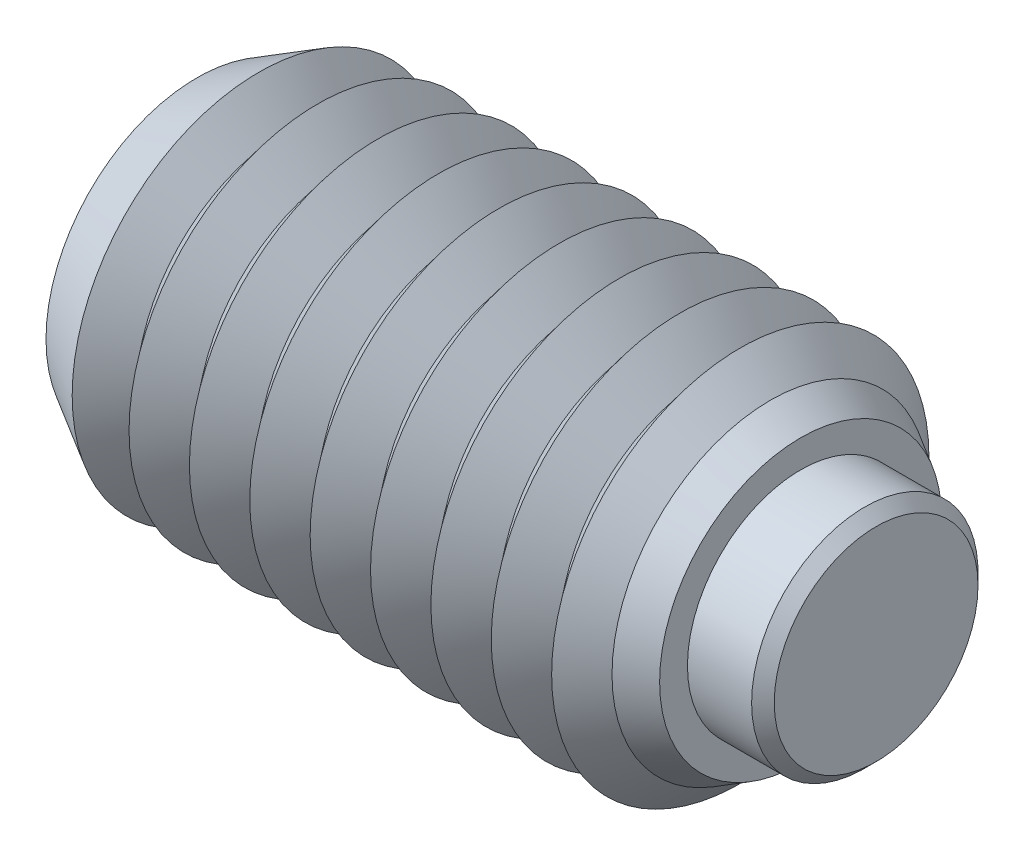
ISO-10303-21;
HEADER;
FILE_DESCRIPTION(('STEP AP214'),'2;1');
FILE_NAME('part.step','',(''),(''),'','','');
FILE_SCHEMA(('AUTOMOTIVE_DESIGN { 1 0 10303 214 1 1 1 1 }'));
ENDSEC;
DATA;
#1=APPLICATION_CONTEXT('core data for automotive mechanical design processes');
#2=APPLICATION_PROTOCOL_DEFINITION('international standard','automotive_design',2000,#1);
#3=PRODUCT_CONTEXT('',#1,'mechanical');
#4=PRODUCT('Part','Part','',(#3));
#5=PRODUCT_RELATED_PRODUCT_CATEGORY('part','',(#4));
#6=PRODUCT_DEFINITION_FORMATION('','',#4);
#7=PRODUCT_DEFINITION_CONTEXT('part definition',#1,'design');
#8=PRODUCT_DEFINITION('design','',#6,#7);
#9=PRODUCT_DEFINITION_SHAPE('','',#8);
#10=(LENGTH_UNIT() NAMED_UNIT(*) SI_UNIT(.MILLI.,.METRE.));
#11=(NAMED_UNIT(*) PLANE_ANGLE_UNIT() SI_UNIT($,.RADIAN.));
#12=(NAMED_UNIT(*) SI_UNIT($,.STERADIAN.) SOLID_ANGLE_UNIT());
#13=UNCERTAINTY_MEASURE_WITH_UNIT(LENGTH_MEASURE(1.E-05),#10,'distance_accuracy_value','');
#14=(GEOMETRIC_REPRESENTATION_CONTEXT(3) GLOBAL_UNCERTAINTY_ASSIGNED_CONTEXT((#13)) GLOBAL_UNIT_ASSIGNED_CONTEXT((#10,
#11,#12)) REPRESENTATION_CONTEXT('',''));
#15=CARTESIAN_POINT('',(0.,0.,0.));
#16=DIRECTION('',(0.,0.,1.));
#17=DIRECTION('',(1.,0.,0.));
#18=AXIS2_PLACEMENT_3D('',#15,#16,#17);
#19=CARTESIAN_POINT('',(1.4,0.,0.));
#20=DIRECTION('',(-1.,0.,0.));
#21=DIRECTION('',(0.,0.,1.));
#22=AXIS2_PLACEMENT_3D('',#19,#20,#21);
#23=CYLINDRICAL_SURFACE('',#22,1.5);
#24=CARTESIAN_POINT('',(1.25,0.,0.));
#25=DIRECTION('',(1.,0.,0.));
#26=DIRECTION('',(0.,0.,-1.));
#27=AXIS2_PLACEMENT_3D('',#24,#25,#26);
#28=CIRCLE('',#27,1.5);
#29=CARTESIAN_POINT('',(1.25,0.,1.5));
#30=VERTEX_POINT('',#29);
#31=EDGE_CURVE('P0_E10',#30,#30,#28,.F.);
#32=ORIENTED_EDGE('',*,*,#31,.T.);
#33=EDGE_LOOP('',(#32));
#34=FACE_BOUND('',#33,.T.);
#35=CARTESIAN_POINT('',(-0.6,0.,0.));
#36=DIRECTION('',(1.,0.,0.));
#37=DIRECTION('',(0.,0.,-1.));
#38=AXIS2_PLACEMENT_3D('',#35,#36,#37);
#39=CIRCLE('',#38,1.5);
#40=CARTESIAN_POINT('',(-0.6,0.,-1.5));
#41=VERTEX_POINT('',#40);
#42=EDGE_CURVE('P0_E25',#41,#41,#39,.T.);
#43=ORIENTED_EDGE('',*,*,#42,.T.);
#44=EDGE_LOOP('',(#43));
#45=FACE_BOUND('',#44,.T.);
#46=ADVANCED_FACE('P0_F14',(#34,#45),#23,.T.);
#47=CARTESIAN_POINT('',(1.4,0.,0.));
#48=DIRECTION('',(1.,0.,0.));
#49=DIRECTION('',(0.,0.,-1.));
#50=AXIS2_PLACEMENT_3D('',#47,#48,#49);
#51=PLANE('',#50);
#52=CARTESIAN_POINT('',(1.4,0.,0.));
#53=DIRECTION('',(1.,0.,0.));
#54=DIRECTION('',(0.,0.,-1.));
#55=AXIS2_PLACEMENT_3D('',#52,#53,#54);
#56=CIRCLE('',#55,1.35);
#57=CARTESIAN_POINT('',(1.4,0.,1.35));
#58=VERTEX_POINT('',#57);
#59=EDGE_CURVE('P0_E21',#58,#58,#56,.T.);
#60=ORIENTED_EDGE('',*,*,#59,.T.);
#61=EDGE_LOOP('',(#60));
#62=FACE_BOUND('',#61,.T.);
#63=ADVANCED_FACE('P0_F35',(#62),#51,.T.);
#64=CARTESIAN_POINT('',(-0.6,0.,0.));
#65=DIRECTION('',(1.,0.,0.));
#66=DIRECTION('',(0.,0.,-1.));
#67=AXIS2_PLACEMENT_3D('',#64,#65,#66);
#68=PLANE('',#67);
#69=ORIENTED_EDGE('',*,*,#42,.F.);
#70=EDGE_LOOP('',(#69));
#71=FACE_BOUND('',#70,.T.);
#72=ADVANCED_FACE('P0_F33',(#71),#68,.F.);
#73=CARTESIAN_POINT('',(1.4,0.,0.));
#74=DIRECTION('',(-1.,0.,0.));
#75=DIRECTION('',(0.,0.,1.));
#76=AXIS2_PLACEMENT_3D('',#73,#74,#75);
#77=CONICAL_SURFACE('',#76,1.35,0.785398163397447);
#78=CARTESIAN_POINT('',(1.25,0.,1.5));
#79=CARTESIAN_POINT('',(1.2515625,0.,1.4984375));
#80=CARTESIAN_POINT('',(1.253125,0.,1.496875));
#81=CARTESIAN_POINT('',(1.25625,0.,1.49375));
#82=CARTESIAN_POINT('',(1.2578125,0.,1.4921875));
#83=CARTESIAN_POINT('',(1.2609375,0.,1.4890625));
#84=CARTESIAN_POINT('',(1.2625,0.,1.4875));
#85=CARTESIAN_POINT('',(1.265625,0.,1.484375));
#86=CARTESIAN_POINT('',(1.2671875,0.,1.4828125));
#87=CARTESIAN_POINT('',(1.2703125,0.,1.4796875));
#88=CARTESIAN_POINT('',(1.271875,0.,1.478125));
#89=CARTESIAN_POINT('',(1.275,0.,1.475));
#90=CARTESIAN_POINT('',(1.2765625,0.,1.4734375));
#91=CARTESIAN_POINT('',(1.2796875,0.,1.4703125));
#92=CARTESIAN_POINT('',(1.28125,0.,1.46875));
#93=CARTESIAN_POINT('',(1.284375,0.,1.465625));
#94=CARTESIAN_POINT('',(1.2859375,0.,1.4640625));
#95=CARTESIAN_POINT('',(1.2890625,0.,1.4609375));
#96=CARTESIAN_POINT('',(1.290625,0.,1.459375));
#97=CARTESIAN_POINT('',(1.29375,0.,1.45625));
#98=CARTESIAN_POINT('',(1.2953125,0.,1.4546875));
#99=CARTESIAN_POINT('',(1.2984375,0.,1.4515625));
#100=CARTESIAN_POINT('',(1.3,0.,1.45));
#101=CARTESIAN_POINT('',(1.303125,0.,1.446875));
#102=CARTESIAN_POINT('',(1.3046875,0.,1.4453125));
#103=CARTESIAN_POINT('',(1.3078125,0.,1.4421875));
#104=CARTESIAN_POINT('',(1.309375,0.,1.440625));
#105=CARTESIAN_POINT('',(1.3125,0.,1.4375));
#106=CARTESIAN_POINT('',(1.3140625,0.,1.4359375));
#107=CARTESIAN_POINT('',(1.3171875,0.,1.4328125));
#108=CARTESIAN_POINT('',(1.31875,0.,1.43125));
#109=CARTESIAN_POINT('',(1.321875,0.,1.428125));
#110=CARTESIAN_POINT('',(1.3234375,0.,1.4265625));
#111=CARTESIAN_POINT('',(1.3265625,0.,1.4234375));
#112=CARTESIAN_POINT('',(1.328125,0.,1.421875));
#113=CARTESIAN_POINT('',(1.33125,0.,1.41875));
#114=CARTESIAN_POINT('',(1.3328125,0.,1.4171875));
#115=CARTESIAN_POINT('',(1.3359375,0.,1.4140625));
#116=CARTESIAN_POINT('',(1.3375,0.,1.4125));
#117=CARTESIAN_POINT('',(1.340625,0.,1.409375));
#118=CARTESIAN_POINT('',(1.3421875,0.,1.4078125));
#119=CARTESIAN_POINT('',(1.3453125,0.,1.4046875));
#120=CARTESIAN_POINT('',(1.346875,0.,1.403125));
#121=CARTESIAN_POINT('',(1.35,0.,1.4));
#122=CARTESIAN_POINT('',(1.3515625,0.,1.3984375));
#123=CARTESIAN_POINT('',(1.3546875,0.,1.3953125));
#124=CARTESIAN_POINT('',(1.35625,0.,1.39375));
#125=CARTESIAN_POINT('',(1.359375,0.,1.390625));
#126=CARTESIAN_POINT('',(1.3609375,0.,1.3890625));
#127=CARTESIAN_POINT('',(1.3640625,0.,1.3859375));
#128=CARTESIAN_POINT('',(1.365625,0.,1.384375));
#129=CARTESIAN_POINT('',(1.36875,0.,1.38125));
#130=CARTESIAN_POINT('',(1.3703125,0.,1.3796875));
#131=CARTESIAN_POINT('',(1.3734375,0.,1.3765625));
#132=CARTESIAN_POINT('',(1.375,0.,1.375));
#133=CARTESIAN_POINT('',(1.378125,0.,1.371875));
#134=CARTESIAN_POINT('',(1.3796875,0.,1.3703125));
#135=CARTESIAN_POINT('',(1.3828125,0.,1.3671875));
#136=CARTESIAN_POINT('',(1.384375,0.,1.365625));
#137=CARTESIAN_POINT('',(1.3875,0.,1.3625));
#138=CARTESIAN_POINT('',(1.3890625,0.,1.3609375));
#139=CARTESIAN_POINT('',(1.3921875,0.,1.3578125));
#140=CARTESIAN_POINT('',(1.39375,0.,1.35625));
#141=CARTESIAN_POINT('',(1.396875,0.,1.353125));
#142=CARTESIAN_POINT('',(1.3984375,0.,1.3515625));
#143=CARTESIAN_POINT('',(1.4,0.,1.35));
#144=B_SPLINE_CURVE_WITH_KNOTS('',3,(#78,#79,#80,#81,#82,#83,#84,#85,#86,#87,#88,#89,#90,#91,
#92,#93,#94,#95,#96,#97,#98,#99,#100,#101,#102,#103,#104,#105,#106,#107,#108,#109,#110,#111,
#112,#113,#114,#115,#116,#117,#118,#119,#120,#121,#122,#123,#124,#125,#126,#127,#128,#129,#130,
#131,#132,#133,#134,#135,#136,#137,#138,#139,#140,#141,#142,#143),.UNSPECIFIED.,.F.,.F.,(4,2,2,
2,2,2,2,2,2,2,2,2,2,2,2,2,2,2,2,2,2,2,2,2,2,2,2,2,2,2,2,2,4),(0.,0.00662912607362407,
0.0132582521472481,0.0198873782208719,0.0265165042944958,0.0331456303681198,0.0397747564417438,
0.0464038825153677,0.0530330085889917,0.0596621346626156,0.0662912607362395,0.0729203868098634,
0.0795495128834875,0.0861786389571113,0.0928077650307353,0.0994368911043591,0.106066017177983,
0.112695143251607,0.119324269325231,0.125953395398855,0.132582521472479,0.139211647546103,
0.145840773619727,0.152469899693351,0.159099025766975,0.165728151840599,0.172357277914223,
0.178986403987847,0.18561553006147,0.192244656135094,0.198873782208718,0.205502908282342,
0.212132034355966),.UNSPECIFIED.);
#145=EDGE_CURVE('P0_BSEAM16',#30,#58,#144,.T.);
#146=ORIENTED_EDGE('',*,*,#31,.F.);
#147=ORIENTED_EDGE('',*,*,#59,.F.);
#148=ORIENTED_EDGE('',*,*,#145,.T.);
#149=ORIENTED_EDGE('',*,*,#145,.F.);
#150=EDGE_LOOP('',(#146,#148,#147,#149));
#151=FACE_BOUND('',#150,.T.);
#152=ADVANCED_FACE('P0_F16',(#151),#77,.T.);
#153=CLOSED_SHELL('',(#46,#63,#72,#152));
#154=MANIFOLD_SOLID_BREP('P0_B1',#153);
#155=CARTESIAN_POINT('',(-6.8,0.,0.));
#156=DIRECTION('',(-1.,0.,0.));
#157=DIRECTION('',(0.,0.,1.));
#158=AXIS2_PLACEMENT_3D('',#155,#156,#157);
#159=CONICAL_SURFACE('',#158,2.5,0.895664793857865);
#160=CARTESIAN_POINT('',(-6.4,0.,0.));
#161=DIRECTION('',(1.,0.,0.));
#162=DIRECTION('',(0.,0.,-1.));
#163=AXIS2_PLACEMENT_3D('',#160,#161,#162);
#164=CIRCLE('',#163,2.00040016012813);
#165=CARTESIAN_POINT('',(-6.4,0.,-2.00040016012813));
#166=VERTEX_POINT('',#165);
#167=EDGE_CURVE('P1_E697',#166,#166,#164,.T.);
#168=ORIENTED_EDGE('',*,*,#167,.F.);
#169=EDGE_LOOP('',(#168));
#170=FACE_BOUND('',#169,.T.);
#171=CARTESIAN_POINT('',(-6.77934698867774,0.,0.));
#172=DIRECTION('',(1.,0.,0.));
#173=DIRECTION('',(0.,0.,-1.));
#174=AXIS2_PLACEMENT_3D('',#171,#172,#173);
#175=CIRCLE('',#174,2.47420439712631);
#176=CARTESIAN_POINT('',(-6.77934698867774,0.,-2.47420439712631));
#177=VERTEX_POINT('',#176);
#178=EDGE_CURVE('P1_E700',#177,#177,#175,.F.);
#179=ORIENTED_EDGE('',*,*,#178,.F.);
#180=EDGE_LOOP('',(#179));
#181=FACE_BOUND('',#180,.T.);
#182=ADVANCED_FACE('P1_F15',(#170,#181),#159,.T.);
#183=CARTESIAN_POINT('',(-0.8,0.,0.));
#184=DIRECTION('',(1.,0.,0.));
#185=DIRECTION('',(0.,0.,-1.));
#186=AXIS2_PLACEMENT_3D('',#183,#184,#185);
#187=CONICAL_SURFACE('',#186,2.00040016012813,0.895664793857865);
#188=CARTESIAN_POINT('',(-0.4,0.,0.));
#189=DIRECTION('',(1.,0.,0.));
#190=DIRECTION('',(0.,0.,-1.));
#191=AXIS2_PLACEMENT_3D('',#188,#189,#190);
#192=CIRCLE('',#191,2.5);
#193=CARTESIAN_POINT('',(-0.4,0.,-2.5));
#194=VERTEX_POINT('',#193);
#195=EDGE_CURVE('P1_E651',#194,#194,#192,.T.);
#196=ORIENTED_EDGE('',*,*,#195,.F.);
#197=EDGE_LOOP('',(#196));
#198=FACE_BOUND('',#197,.T.);
#199=CARTESIAN_POINT('',(-0.8,0.,0.));
#200=DIRECTION('',(1.,0.,0.));
#201=DIRECTION('',(0.,0.,-1.));
#202=AXIS2_PLACEMENT_3D('',#199,#200,#201);
#203=CIRCLE('',#202,2.00040016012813);
#204=CARTESIAN_POINT('',(-0.8,0.,-2.00040016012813));
#205=VERTEX_POINT('',#204);
#206=EDGE_CURVE('P1_E652',#205,#205,#203,.T.);
#207=ORIENTED_EDGE('',*,*,#206,.T.);
#208=EDGE_LOOP('',(#207));
#209=FACE_BOUND('',#208,.T.);
#210=ADVANCED_FACE('P1_F222',(#198,#209),#187,.T.);
#211=CARTESIAN_POINT('',(-1.2,0.,0.));
#212=DIRECTION('',(-1.,0.,0.));
#213=DIRECTION('',(0.,0.,1.));
#214=AXIS2_PLACEMENT_3D('',#211,#212,#213);
#215=CONICAL_SURFACE('',#214,2.5,0.895664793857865);
#216=ORIENTED_EDGE('',*,*,#206,.F.);
#217=EDGE_LOOP('',(#216));
#218=FACE_BOUND('',#217,.T.);
#219=CARTESIAN_POINT('',(-1.2,0.,0.));
#220=DIRECTION('',(1.,0.,0.));
#221=DIRECTION('',(0.,0.,-1.));
#222=AXIS2_PLACEMENT_3D('',#219,#220,#221);
#223=CIRCLE('',#222,2.5);
#224=CARTESIAN_POINT('',(-1.2,0.,-2.5));
#225=VERTEX_POINT('',#224);
#226=EDGE_CURVE('P1_E656',#225,#225,#223,.T.);
#227=ORIENTED_EDGE('',*,*,#226,.T.);
#228=EDGE_LOOP('',(#227));
#229=FACE_BOUND('',#228,.T.);
#230=ADVANCED_FACE('P1_F227',(#218,#229),#215,.T.);
#231=CARTESIAN_POINT('',(-0.6,0.,0.));
#232=DIRECTION('',(1.,0.,0.));
#233=DIRECTION('',(0.,1.,0.));
#234=AXIS2_PLACEMENT_3D('',#231,#232,#233);
#235=PLANE('',#234);
#236=CARTESIAN_POINT('',(-0.6,0.,0.));
#237=DIRECTION('',(1.,0.,0.));
#238=DIRECTION('',(0.,1.,0.));
#239=AXIS2_PLACEMENT_3D('',#236,#237,#238);
#240=CIRCLE('',#239,1.5);
#241=CARTESIAN_POINT('',(-0.6,1.5,0.));
#242=VERTEX_POINT('',#241);
#243=EDGE_CURVE('P1_E358',#242,#242,#240,.T.);
#244=ORIENTED_EDGE('',*,*,#243,.T.);
#245=EDGE_LOOP('',(#244));
#246=FACE_BOUND('',#245,.T.);
#247=ADVANCED_FACE('P1_F285',(#246),#235,.T.);
#248=CARTESIAN_POINT('',(-0.6,0.,0.));
#249=DIRECTION('',(1.,0.,0.));
#250=DIRECTION('',(0.,1.,0.));
#251=AXIS2_PLACEMENT_3D('',#248,#249,#250);
#252=CYLINDRICAL_SURFACE('',#251,1.5);
#253=ORIENTED_EDGE('',*,*,#243,.F.);
#254=EDGE_LOOP('',(#253));
#255=FACE_BOUND('',#254,.T.);
#256=CARTESIAN_POINT('',(0.4,0.,0.));
#257=DIRECTION('',(1.,0.,0.));
#258=DIRECTION('',(0.,1.,0.));
#259=AXIS2_PLACEMENT_3D('',#256,#257,#258);
#260=CIRCLE('',#259,1.5);
#261=CARTESIAN_POINT('',(0.4,1.5,0.));
#262=VERTEX_POINT('',#261);
#263=EDGE_CURVE('P1_E361',#262,#262,#260,.T.);
#264=ORIENTED_EDGE('',*,*,#263,.T.);
#265=EDGE_LOOP('',(#264));
#266=FACE_BOUND('',#265,.T.);
#267=ADVANCED_FACE('P1_F209',(#255,#266),#252,.F.);
#268=CARTESIAN_POINT('',(0.4,1.86905989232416,0.));
#269=DIRECTION('',(1.,0.,0.));
#270=DIRECTION('',(0.,1.,0.));
#271=AXIS2_PLACEMENT_3D('',#268,#269,#270);
#272=PLANE('',#271);
#273=ORIENTED_EDGE('',*,*,#263,.F.);
#274=EDGE_LOOP('',(#273));
#275=FACE_BOUND('',#274,.T.);
#276=CARTESIAN_POINT('',(0.4,0.,0.));
#277=DIRECTION('',(1.,0.,0.));
#278=DIRECTION('',(0.,1.,0.));
#279=AXIS2_PLACEMENT_3D('',#276,#277,#278);
#280=CIRCLE('',#279,1.86905989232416);
#281=CARTESIAN_POINT('',(0.4,1.86905989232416,0.));
#282=VERTEX_POINT('',#281);
#283=EDGE_CURVE('P1_E121',#282,#282,#280,.T.);
#284=ORIENTED_EDGE('',*,*,#283,.T.);
#285=EDGE_LOOP('',(#284));
#286=FACE_BOUND('',#285,.T.);
#287=ADVANCED_FACE('P1_F206',(#275,#286),#272,.T.);
#288=CARTESIAN_POINT('',(0.4,0.,0.));
#289=DIRECTION('',(-1.,0.,0.));
#290=DIRECTION('',(0.,-1.,0.));
#291=AXIS2_PLACEMENT_3D('',#288,#289,#290);
#292=CONICAL_SURFACE('',#291,1.86905989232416,0.523598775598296);
#293=CARTESIAN_POINT('',(0.,0.,0.));
#294=DIRECTION('',(1.,0.,0.));
#295=DIRECTION('',(0.,0.,-1.));
#296=AXIS2_PLACEMENT_3D('',#293,#294,#295);
#297=CIRCLE('',#296,2.1);
#298=CARTESIAN_POINT('',(0.,0.,-2.1));
#299=VERTEX_POINT('',#298);
#300=EDGE_CURVE('P1_E349',#299,#299,#297,.T.);
#301=ORIENTED_EDGE('',*,*,#300,.T.);
#302=EDGE_LOOP('',(#301));
#303=FACE_BOUND('',#302,.T.);
#304=ORIENTED_EDGE('',*,*,#283,.F.);
#305=EDGE_LOOP('',(#304));
#306=FACE_BOUND('',#305,.T.);
#307=ADVANCED_FACE('P1_F203',(#303,#306),#292,.T.);
#308=CARTESIAN_POINT('',(0.,0.,0.));
#309=DIRECTION('',(-1.,0.,0.));
#310=DIRECTION('',(0.,0.,1.));
#311=AXIS2_PLACEMENT_3D('',#308,#309,#310);
#312=CONICAL_SURFACE('',#311,2.1,0.785398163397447);
#313=ORIENTED_EDGE('',*,*,#195,.T.);
#314=EDGE_LOOP('',(#313));
#315=FACE_BOUND('',#314,.T.);
#316=ORIENTED_EDGE('',*,*,#300,.F.);
#317=EDGE_LOOP('',(#316));
#318=FACE_BOUND('',#317,.T.);
#319=ADVANCED_FACE('P1_F17',(#315,#318),#312,.T.);
#320=CARTESIAN_POINT('',(-1.6,0.,0.));
#321=DIRECTION('',(1.,0.,0.));
#322=DIRECTION('',(0.,0.,-1.));
#323=AXIS2_PLACEMENT_3D('',#320,#321,#322);
#324=CONICAL_SURFACE('',#323,2.00040016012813,0.895664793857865);
#325=ORIENTED_EDGE('',*,*,#226,.F.);
#326=EDGE_LOOP('',(#325));
#327=FACE_BOUND('',#326,.T.);
#328=CARTESIAN_POINT('',(-1.6,0.,0.));
#329=DIRECTION('',(1.,0.,0.));
#330=DIRECTION('',(0.,0.,-1.));
#331=AXIS2_PLACEMENT_3D('',#328,#329,#330);
#332=CIRCLE('',#331,2.00040016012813);
#333=CARTESIAN_POINT('',(-1.6,0.,-2.00040016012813));
#334=VERTEX_POINT('',#333);
#335=EDGE_CURVE('P1_E661',#334,#334,#332,.T.);
#336=ORIENTED_EDGE('',*,*,#335,.T.);
#337=EDGE_LOOP('',(#336));
#338=FACE_BOUND('',#337,.T.);
#339=ADVANCED_FACE('P1_F279',(#327,#338),#324,.T.);
#340=CARTESIAN_POINT('',(-2.,0.,0.));
#341=DIRECTION('',(-1.,0.,0.));
#342=DIRECTION('',(0.,0.,1.));
#343=AXIS2_PLACEMENT_3D('',#340,#341,#342);
#344=CONICAL_SURFACE('',#343,2.5,0.895664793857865);
#345=ORIENTED_EDGE('',*,*,#335,.F.);
#346=EDGE_LOOP('',(#345));
#347=FACE_BOUND('',#346,.T.);
#348=CARTESIAN_POINT('',(-2.,0.,0.));
#349=DIRECTION('',(1.,0.,0.));
#350=DIRECTION('',(0.,0.,-1.));
#351=AXIS2_PLACEMENT_3D('',#348,#349,#350);
#352=CIRCLE('',#351,2.5);
#353=CARTESIAN_POINT('',(-2.,0.,-2.5));
#354=VERTEX_POINT('',#353);
#355=EDGE_CURVE('P1_E664',#354,#354,#352,.T.);
#356=ORIENTED_EDGE('',*,*,#355,.T.);
#357=EDGE_LOOP('',(#356));
#358=FACE_BOUND('',#357,.T.);
#359=ADVANCED_FACE('P1_F275',(#347,#358),#344,.T.);
#360=CARTESIAN_POINT('',(-2.4,0.,0.));
#361=DIRECTION('',(1.,0.,0.));
#362=DIRECTION('',(0.,0.,-1.));
#363=AXIS2_PLACEMENT_3D('',#360,#361,#362);
#364=CONICAL_SURFACE('',#363,2.00040016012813,0.895664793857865);
#365=ORIENTED_EDGE('',*,*,#355,.F.);
#366=EDGE_LOOP('',(#365));
#367=FACE_BOUND('',#366,.T.);
#368=CARTESIAN_POINT('',(-2.4,0.,0.));
#369=DIRECTION('',(1.,0.,0.));
#370=DIRECTION('',(0.,0.,-1.));
#371=AXIS2_PLACEMENT_3D('',#368,#369,#370);
#372=CIRCLE('',#371,2.00040016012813);
#373=CARTESIAN_POINT('',(-2.4,0.,-2.00040016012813));
#374=VERTEX_POINT('',#373);
#375=EDGE_CURVE('P1_E667',#374,#374,#372,.T.);
#376=ORIENTED_EDGE('',*,*,#375,.T.);
#377=EDGE_LOOP('',(#376));
#378=FACE_BOUND('',#377,.T.);
#379=ADVANCED_FACE('P1_F271',(#367,#378),#364,.T.);
#380=CARTESIAN_POINT('',(-2.8,0.,0.));
#381=DIRECTION('',(-1.,0.,0.));
#382=DIRECTION('',(0.,0.,1.));
#383=AXIS2_PLACEMENT_3D('',#380,#381,#382);
#384=CONICAL_SURFACE('',#383,2.5,0.895664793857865);
#385=ORIENTED_EDGE('',*,*,#375,.F.);
#386=EDGE_LOOP('',(#385));
#387=FACE_BOUND('',#386,.T.);
#388=CARTESIAN_POINT('',(-2.8,0.,0.));
#389=DIRECTION('',(1.,0.,0.));
#390=DIRECTION('',(0.,0.,-1.));
#391=AXIS2_PLACEMENT_3D('',#388,#389,#390);
#392=CIRCLE('',#391,2.5);
#393=CARTESIAN_POINT('',(-2.8,0.,-2.5));
#394=VERTEX_POINT('',#393);
#395=EDGE_CURVE('P1_E670',#394,#394,#392,.T.);
#396=ORIENTED_EDGE('',*,*,#395,.T.);
#397=EDGE_LOOP('',(#396));
#398=FACE_BOUND('',#397,.T.);
#399=ADVANCED_FACE('P1_F267',(#387,#398),#384,.T.);
#400=CARTESIAN_POINT('',(-3.2,0.,0.));
#401=DIRECTION('',(1.,0.,0.));
#402=DIRECTION('',(0.,0.,-1.));
#403=AXIS2_PLACEMENT_3D('',#400,#401,#402);
#404=CONICAL_SURFACE('',#403,2.00040016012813,0.895664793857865);
#405=ORIENTED_EDGE('',*,*,#395,.F.);
#406=EDGE_LOOP('',(#405));
#407=FACE_BOUND('',#406,.T.);
#408=CARTESIAN_POINT('',(-3.2,0.,0.));
#409=DIRECTION('',(1.,0.,0.));
#410=DIRECTION('',(0.,0.,-1.));
#411=AXIS2_PLACEMENT_3D('',#408,#409,#410);
#412=CIRCLE('',#411,2.00040016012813);
#413=CARTESIAN_POINT('',(-3.2,0.,-2.00040016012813));
#414=VERTEX_POINT('',#413);
#415=EDGE_CURVE('P1_E673',#414,#414,#412,.T.);
#416=ORIENTED_EDGE('',*,*,#415,.T.);
#417=EDGE_LOOP('',(#416));
#418=FACE_BOUND('',#417,.T.);
#419=ADVANCED_FACE('P1_F263',(#407,#418),#404,.T.);
#420=CARTESIAN_POINT('',(-3.6,0.,0.));
#421=DIRECTION('',(-1.,0.,0.));
#422=DIRECTION('',(0.,0.,1.));
#423=AXIS2_PLACEMENT_3D('',#420,#421,#422);
#424=CONICAL_SURFACE('',#423,2.5,0.895664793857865);
#425=ORIENTED_EDGE('',*,*,#415,.F.);
#426=EDGE_LOOP('',(#425));
#427=FACE_BOUND('',#426,.T.);
#428=CARTESIAN_POINT('',(-3.6,0.,0.));
#429=DIRECTION('',(1.,0.,0.));
#430=DIRECTION('',(0.,0.,-1.));
#431=AXIS2_PLACEMENT_3D('',#428,#429,#430);
#432=CIRCLE('',#431,2.5);
#433=CARTESIAN_POINT('',(-3.6,0.,-2.5));
#434=VERTEX_POINT('',#433);
#435=EDGE_CURVE('P1_E676',#434,#434,#432,.T.);
#436=ORIENTED_EDGE('',*,*,#435,.T.);
#437=EDGE_LOOP('',(#436));
#438=FACE_BOUND('',#437,.T.);
#439=ADVANCED_FACE('P1_F259',(#427,#438),#424,.T.);
#440=CARTESIAN_POINT('',(-4.,0.,0.));
#441=DIRECTION('',(1.,0.,0.));
#442=DIRECTION('',(0.,0.,-1.));
#443=AXIS2_PLACEMENT_3D('',#440,#441,#442);
#444=CONICAL_SURFACE('',#443,2.00040016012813,0.895664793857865);
#445=ORIENTED_EDGE('',*,*,#435,.F.);
#446=EDGE_LOOP('',(#445));
#447=FACE_BOUND('',#446,.T.);
#448=CARTESIAN_POINT('',(-4.,0.,0.));
#449=DIRECTION('',(1.,0.,0.));
#450=DIRECTION('',(0.,0.,-1.));
#451=AXIS2_PLACEMENT_3D('',#448,#449,#450);
#452=CIRCLE('',#451,2.00040016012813);
#453=CARTESIAN_POINT('',(-4.,0.,-2.00040016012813));
#454=VERTEX_POINT('',#453);
#455=EDGE_CURVE('P1_E679',#454,#454,#452,.T.);
#456=ORIENTED_EDGE('',*,*,#455,.T.);
#457=EDGE_LOOP('',(#456));
#458=FACE_BOUND('',#457,.T.);
#459=ADVANCED_FACE('P1_F255',(#447,#458),#444,.T.);
#460=CARTESIAN_POINT('',(-4.4,0.,0.));
#461=DIRECTION('',(-1.,0.,0.));
#462=DIRECTION('',(0.,0.,1.));
#463=AXIS2_PLACEMENT_3D('',#460,#461,#462);
#464=CONICAL_SURFACE('',#463,2.5,0.895664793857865);
#465=ORIENTED_EDGE('',*,*,#455,.F.);
#466=EDGE_LOOP('',(#465));
#467=FACE_BOUND('',#466,.T.);
#468=CARTESIAN_POINT('',(-4.4,0.,0.));
#469=DIRECTION('',(1.,0.,0.));
#470=DIRECTION('',(0.,0.,-1.));
#471=AXIS2_PLACEMENT_3D('',#468,#469,#470);
#472=CIRCLE('',#471,2.5);
#473=CARTESIAN_POINT('',(-4.4,0.,-2.5));
#474=VERTEX_POINT('',#473);
#475=EDGE_CURVE('P1_E682',#474,#474,#472,.T.);
#476=ORIENTED_EDGE('',*,*,#475,.T.);
#477=EDGE_LOOP('',(#476));
#478=FACE_BOUND('',#477,.T.);
#479=ADVANCED_FACE('P1_F251',(#467,#478),#464,.T.);
#480=CARTESIAN_POINT('',(-4.8,0.,0.));
#481=DIRECTION('',(1.,0.,0.));
#482=DIRECTION('',(0.,0.,-1.));
#483=AXIS2_PLACEMENT_3D('',#480,#481,#482);
#484=CONICAL_SURFACE('',#483,2.00040016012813,0.895664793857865);
#485=ORIENTED_EDGE('',*,*,#475,.F.);
#486=EDGE_LOOP('',(#485));
#487=FACE_BOUND('',#486,.T.);
#488=CARTESIAN_POINT('',(-4.8,0.,0.));
#489=DIRECTION('',(1.,0.,0.));
#490=DIRECTION('',(0.,0.,-1.));
#491=AXIS2_PLACEMENT_3D('',#488,#489,#490);
#492=CIRCLE('',#491,2.00040016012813);
#493=CARTESIAN_POINT('',(-4.8,0.,-2.00040016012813));
#494=VERTEX_POINT('',#493);
#495=EDGE_CURVE('P1_E685',#494,#494,#492,.T.);
#496=ORIENTED_EDGE('',*,*,#495,.T.);
#497=EDGE_LOOP('',(#496));
#498=FACE_BOUND('',#497,.T.);
#499=ADVANCED_FACE('P1_F247',(#487,#498),#484,.T.);
#500=CARTESIAN_POINT('',(-5.2,0.,0.));
#501=DIRECTION('',(-1.,0.,0.));
#502=DIRECTION('',(0.,0.,1.));
#503=AXIS2_PLACEMENT_3D('',#500,#501,#502);
#504=CONICAL_SURFACE('',#503,2.5,0.895664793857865);
#505=ORIENTED_EDGE('',*,*,#495,.F.);
#506=EDGE_LOOP('',(#505));
#507=FACE_BOUND('',#506,.T.);
#508=CARTESIAN_POINT('',(-5.2,0.,0.));
#509=DIRECTION('',(1.,0.,0.));
#510=DIRECTION('',(0.,0.,-1.));
#511=AXIS2_PLACEMENT_3D('',#508,#509,#510);
#512=CIRCLE('',#511,2.5);
#513=CARTESIAN_POINT('',(-5.2,0.,-2.5));
#514=VERTEX_POINT('',#513);
#515=EDGE_CURVE('P1_E688',#514,#514,#512,.T.);
#516=ORIENTED_EDGE('',*,*,#515,.T.);
#517=EDGE_LOOP('',(#516));
#518=FACE_BOUND('',#517,.T.);
#519=ADVANCED_FACE('P1_F243',(#507,#518),#504,.T.);
#520=CARTESIAN_POINT('',(-5.6,0.,0.));
#521=DIRECTION('',(1.,0.,0.));
#522=DIRECTION('',(0.,0.,-1.));
#523=AXIS2_PLACEMENT_3D('',#520,#521,#522);
#524=CONICAL_SURFACE('',#523,2.00040016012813,0.895664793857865);
#525=ORIENTED_EDGE('',*,*,#515,.F.);
#526=EDGE_LOOP('',(#525));
#527=FACE_BOUND('',#526,.T.);
#528=CARTESIAN_POINT('',(-5.6,0.,0.));
#529=DIRECTION('',(1.,0.,0.));
#530=DIRECTION('',(0.,0.,-1.));
#531=AXIS2_PLACEMENT_3D('',#528,#529,#530);
#532=CIRCLE('',#531,2.00040016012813);
#533=CARTESIAN_POINT('',(-5.6,0.,-2.00040016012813));
#534=VERTEX_POINT('',#533);
#535=EDGE_CURVE('P1_E691',#534,#534,#532,.T.);
#536=ORIENTED_EDGE('',*,*,#535,.T.);
#537=EDGE_LOOP('',(#536));
#538=FACE_BOUND('',#537,.T.);
#539=ADVANCED_FACE('P1_F239',(#527,#538),#524,.T.);
#540=CARTESIAN_POINT('',(-6.,0.,0.));
#541=DIRECTION('',(-1.,0.,0.));
#542=DIRECTION('',(0.,0.,1.));
#543=AXIS2_PLACEMENT_3D('',#540,#541,#542);
#544=CONICAL_SURFACE('',#543,2.5,0.895664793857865);
#545=ORIENTED_EDGE('',*,*,#535,.F.);
#546=EDGE_LOOP('',(#545));
#547=FACE_BOUND('',#546,.T.);
#548=CARTESIAN_POINT('',(-6.,0.,0.));
#549=DIRECTION('',(1.,0.,0.));
#550=DIRECTION('',(0.,0.,-1.));
#551=AXIS2_PLACEMENT_3D('',#548,#549,#550);
#552=CIRCLE('',#551,2.5);
#553=CARTESIAN_POINT('',(-6.,0.,-2.5));
#554=VERTEX_POINT('',#553);
#555=EDGE_CURVE('P1_E694',#554,#554,#552,.T.);
#556=ORIENTED_EDGE('',*,*,#555,.T.);
#557=EDGE_LOOP('',(#556));
#558=FACE_BOUND('',#557,.T.);
#559=ADVANCED_FACE('P1_F235',(#547,#558),#544,.T.);
#560=CARTESIAN_POINT('',(-6.4,0.,0.));
#561=DIRECTION('',(1.,0.,0.));
#562=DIRECTION('',(0.,0.,-1.));
#563=AXIS2_PLACEMENT_3D('',#560,#561,#562);
#564=CONICAL_SURFACE('',#563,2.00040016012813,0.895664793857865);
#565=ORIENTED_EDGE('',*,*,#555,.F.);
#566=EDGE_LOOP('',(#565));
#567=FACE_BOUND('',#566,.T.);
#568=ORIENTED_EDGE('',*,*,#167,.T.);
#569=EDGE_LOOP('',(#568));
#570=FACE_BOUND('',#569,.T.);
#571=ADVANCED_FACE('P1_F219',(#567,#570),#564,.T.);
#572=CARTESIAN_POINT('',(-7.6,0.,0.));
#573=DIRECTION('',(1.,0.,0.));
#574=DIRECTION('',(0.,0.,1.));
#575=AXIS2_PLACEMENT_3D('',#572,#573,#574);
#576=CONICAL_SURFACE('',#575,2.00040016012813,0.5235987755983);
#577=CARTESIAN_POINT('',(-7.6,0.,0.));
#578=DIRECTION('',(-1.,0.,0.));
#579=DIRECTION('',(0.,0.,1.));
#580=AXIS2_PLACEMENT_3D('',#577,#578,#579);
#581=CIRCLE('',#580,2.00040016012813);
#582=CARTESIAN_POINT('',(-7.6,0.,2.00040016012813));
#583=VERTEX_POINT('',#582);
#584=EDGE_CURVE('P1_E702',#583,#583,#581,.T.);
#585=ORIENTED_EDGE('',*,*,#584,.F.);
#586=EDGE_LOOP('',(#585));
#587=FACE_BOUND('',#586,.T.);
#588=ORIENTED_EDGE('',*,*,#178,.T.);
#589=EDGE_LOOP('',(#588));
#590=FACE_BOUND('',#589,.T.);
#591=ADVANCED_FACE('P1_F159',(#587,#590),#576,.T.);
#592=CARTESIAN_POINT('',(-7.6,0.,0.));
#593=DIRECTION('',(1.,0.,0.));
#594=DIRECTION('',(0.,0.,-1.));
#595=AXIS2_PLACEMENT_3D('',#592,#593,#594);
#596=PLANE('',#595);
#597=CARTESIAN_POINT('',(-7.6,0.,0.));
#598=DIRECTION('',(1.,0.,0.));
#599=DIRECTION('',(0.,0.,-1.));
#600=AXIS2_PLACEMENT_3D('',#597,#598,#599);
#601=CIRCLE('',#600,1.44337567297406);
#602=CARTESIAN_POINT('',(-7.6,-1.25,-0.72168783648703));
#603=VERTEX_POINT('',#602);
#604=CARTESIAN_POINT('',(-7.6,0.,-1.44337567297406));
#605=VERTEX_POINT('',#604);
#606=EDGE_CURVE('P1_E19',#603,#605,#601,.T.);
#607=ORIENTED_EDGE('',*,*,#606,.T.);
#608=CARTESIAN_POINT('',(-7.6,1.25,-0.721687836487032));
#609=VERTEX_POINT('',#608);
#610=EDGE_CURVE('P1_E10',#605,#609,#601,.T.);
#611=ORIENTED_EDGE('',*,*,#610,.T.);
#612=CARTESIAN_POINT('',(-7.6,1.25,0.721687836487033));
#613=VERTEX_POINT('',#612);
#614=EDGE_CURVE('P1_E24',#609,#613,#601,.T.);
#615=ORIENTED_EDGE('',*,*,#614,.T.);
#616=CARTESIAN_POINT('',(-7.6,0.,0.));
#617=DIRECTION('',(-1.,0.,0.));
#618=DIRECTION('',(0.,0.,1.));
#619=AXIS2_PLACEMENT_3D('',#616,#617,#618);
#620=CIRCLE('',#619,1.44337567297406);
#621=CARTESIAN_POINT('',(-7.6,0.,1.44337567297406));
#622=VERTEX_POINT('',#621);
#623=EDGE_CURVE('P1_E92',#622,#613,#620,.T.);
#624=ORIENTED_EDGE('',*,*,#623,.F.);
#625=CARTESIAN_POINT('',(-7.6,-1.25,0.721687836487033));
#626=VERTEX_POINT('',#625);
#627=EDGE_CURVE('P1_E101',#622,#626,#601,.T.);
#628=ORIENTED_EDGE('',*,*,#627,.T.);
#629=EDGE_CURVE('P1_E107',#626,#603,#601,.T.);
#630=ORIENTED_EDGE('',*,*,#629,.T.);
#631=EDGE_LOOP('',(#607,#611,#615,#624,#628,#630));
#632=FACE_BOUND('',#631,.T.);
#633=ORIENTED_EDGE('',*,*,#584,.T.);
#634=EDGE_LOOP('',(#633));
#635=FACE_BOUND('',#634,.T.);
#636=ADVANCED_FACE('P1_F108',(#632,#635),#596,.F.);
#637=CARTESIAN_POINT('',(-7.6,0.,0.));
#638=DIRECTION('',(-1.,0.,0.));
#639=DIRECTION('',(0.,0.,1.));
#640=AXIS2_PLACEMENT_3D('',#637,#638,#639);
#641=CONICAL_SURFACE('',#640,1.44337567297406,1.0471975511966);
#642=ORIENTED_EDGE('',*,*,#606,.F.);
#643=CARTESIAN_POINT('',(-7.60006667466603,0.000200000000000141,-1.4434911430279));
#644=CARTESIAN_POINT('',(-7.58174591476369,-0.0547333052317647,-1.41177538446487));
#645=CARTESIAN_POINT('',(-7.56508330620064,-0.110140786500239,-1.37978586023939));
#646=CARTESIAN_POINT('',(-7.53599730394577,-0.22191536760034,-1.31525277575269));
#647=CARTESIAN_POINT('',(-7.52358420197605,-0.27828445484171,-1.28270806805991));
#648=CARTESIAN_POINT('',(-7.50425968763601,-0.390323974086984,-1.21802202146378));
#649=CARTESIAN_POINT('',(-7.49721968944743,-0.445977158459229,-1.1858906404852));
#650=CARTESIAN_POINT('',(-7.48881243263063,-0.557545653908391,-1.12147653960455));
#651=CARTESIAN_POINT('',(-7.48743821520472,-0.6134605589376,-1.08919405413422));
#652=CARTESIAN_POINT('',(-7.49028333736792,-0.717957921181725,-1.02886247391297));
#653=CARTESIAN_POINT('',(-7.49380409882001,-0.766555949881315,-1.00080438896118));
#654=CARTESIAN_POINT('',(-7.50496711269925,-0.863435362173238,-0.944871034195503));
#655=CARTESIAN_POINT('',(-7.51261318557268,-0.911716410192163,-0.916995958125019));
#656=CARTESIAN_POINT('',(-7.53172945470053,-1.00879588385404,-0.860947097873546));
#657=CARTESIAN_POINT('',(-7.54328075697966,-1.0575820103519,-0.832780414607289));
#658=CARTESIAN_POINT('',(-7.56949831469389,-1.1544262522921,-0.776867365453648));
#659=CARTESIAN_POINT('',(-7.5841584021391,-1.20248561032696,-0.749120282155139));
#660=CARTESIAN_POINT('',(-7.60006667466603,-1.2502,-0.721572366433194));
#661=B_SPLINE_CURVE_WITH_KNOTS('',3,(#643,#644,#645,#646,#647,#648,#649,#650,#651,#652,#653,
#654,#655,#656,#657,#658,#659,#660),.UNSPECIFIED.,.F.,.F.,(4,2,2,2,2,2,2,2,4),(0.,
0.198150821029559,0.396778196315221,0.590488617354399,0.783961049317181,0.952480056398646,
1.1211553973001,1.2935743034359,1.4656542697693),.UNSPECIFIED.);
#662=EDGE_CURVE('P1_E130',#605,#603,#661,.T.);
#663=ORIENTED_EDGE('',*,*,#662,.F.);
#664=EDGE_LOOP('',(#642,#663));
#665=FACE_BOUND('',#664,.T.);
#666=ADVANCED_FACE('P1_F158',(#665),#641,.F.);
#667=ORIENTED_EDGE('',*,*,#629,.F.);
#668=CARTESIAN_POINT('',(-8.06479411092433,-1.25,-1.86893140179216));
#669=CARTESIAN_POINT('',(-8.03889683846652,-1.25,-1.81495202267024));
#670=CARTESIAN_POINT('',(-8.01326862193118,-1.25,-1.76084125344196));
#671=CARTESIAN_POINT('',(-7.96270276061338,-1.25,-1.65228662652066));
#672=CARTESIAN_POINT('',(-7.9377652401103,-1.25,-1.59784271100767));
#673=CARTESIAN_POINT('',(-7.88859391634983,-1.25,-1.48823931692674));
#674=CARTESIAN_POINT('',(-7.86436529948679,-1.25,-1.43307750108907));
#675=CARTESIAN_POINT('',(-7.81699507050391,-1.25,-1.3222918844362));
#676=CARTESIAN_POINT('',(-7.79385340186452,-1.25,-1.26666810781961));
#677=CARTESIAN_POINT('',(-7.7483546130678,-1.25,-1.15340083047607));
#678=CARTESIAN_POINT('',(-7.7260338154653,-1.25,-1.09574254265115));
#679=CARTESIAN_POINT('',(-7.68325547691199,-1.25,-0.979741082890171));
#680=CARTESIAN_POINT('',(-7.66279816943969,-1.25,-0.921397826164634));
#681=CARTESIAN_POINT('',(-7.60508423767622,-1.25,-0.745435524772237));
#682=CARTESIAN_POINT('',(-7.5713502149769,-1.25,-0.626561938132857));
#683=CARTESIAN_POINT('',(-7.53222040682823,-1.25,-0.445873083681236));
#684=CARTESIAN_POINT('',(-7.52109406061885,-1.25,-0.385304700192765));
#685=CARTESIAN_POINT('',(-7.50342785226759,-1.25,-0.263486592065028));
#686=CARTESIAN_POINT('',(-7.49688768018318,-1.25,-0.202236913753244));
#687=CARTESIAN_POINT('',(-7.48899878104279,-1.25,-0.0801324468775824));
#688=CARTESIAN_POINT('',(-7.48758879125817,-1.25,-0.0192817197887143));
#689=CARTESIAN_POINT('',(-7.48991618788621,-1.25,0.102319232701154));
#690=CARTESIAN_POINT('',(-7.49365389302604,-1.25,0.163069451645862));
#691=CARTESIAN_POINT('',(-7.50889802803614,-1.25,0.312961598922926));
#692=CARTESIAN_POINT('',(-7.5232612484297,-1.25,0.401813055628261));
#693=CARTESIAN_POINT('',(-7.56029984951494,-1.25,0.5777881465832));
#694=CARTESIAN_POINT('',(-7.58298524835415,-1.25,0.66490956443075));
#695=CARTESIAN_POINT('',(-7.62173745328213,-1.25,0.795209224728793));
#696=CARTESIAN_POINT('',(-7.63562294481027,-1.25,0.839061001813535));
#697=CARTESIAN_POINT('',(-7.66467841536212,-1.25,0.926308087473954));
#698=CARTESIAN_POINT('',(-7.67984759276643,-1.25,0.969703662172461));
#699=CARTESIAN_POINT('',(-7.71125013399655,-1.25,1.05609633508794));
#700=CARTESIAN_POINT('',(-7.72748330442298,-1.25,1.09909350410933));
#701=CARTESIAN_POINT('',(-7.76083824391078,-1.25,1.1847490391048));
#702=CARTESIAN_POINT('',(-7.77796016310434,-1.25,1.22740734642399));
#703=CARTESIAN_POINT('',(-7.82276142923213,-1.25,1.33629459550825));
#704=CARTESIAN_POINT('',(-7.85096938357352,-1.25,1.40230581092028));
#705=CARTESIAN_POINT('',(-7.90874508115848,-1.25,1.53373213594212));
#706=CARTESIAN_POINT('',(-7.93831292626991,-1.25,1.59914720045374));
#707=CARTESIAN_POINT('',(-8.02857692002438,-1.25,1.79469680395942));
#708=CARTESIAN_POINT('',(-8.09082427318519,-1.25,1.92411390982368));
#709=CARTESIAN_POINT('',(-8.21792962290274,-1.25,2.18184246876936));
#710=CARTESIAN_POINT('',(-8.28279073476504,-1.25,2.31015236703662));
#711=CARTESIAN_POINT('',(-8.41418074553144,-1.25,2.56589305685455));
#712=CARTESIAN_POINT('',(-8.48070943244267,-1.25,2.69332395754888));
#713=CARTESIAN_POINT('',(-8.60858200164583,-1.25,2.93557826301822));
#714=CARTESIAN_POINT('',(-8.66982257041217,-1.25,3.05045639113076));
#715=CARTESIAN_POINT('',(-8.79300148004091,-1.25,3.27984311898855));
#716=CARTESIAN_POINT('',(-8.85493984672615,-1.25,3.39435170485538));
#717=CARTESIAN_POINT('',(-8.97918115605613,-1.25,3.62279327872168));
#718=CARTESIAN_POINT('',(-9.04148277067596,-1.25,3.73672698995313));
#719=CARTESIAN_POINT('',(-9.16649149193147,-1.25,3.96436406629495));
#720=CARTESIAN_POINT('',(-9.22919857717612,-1.25,4.07806744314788));
#721=CARTESIAN_POINT('',(-9.29205434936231,-1.25,4.19168806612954));
#722=B_SPLINE_CURVE_WITH_KNOTS('',3,(#668,#669,#670,#671,#672,#673,#674,#675,#676,#677,#678,
#679,#680,#681,#682,#683,#684,#685,#686,#687,#688,#689,#690,#691,#692,#693,#694,#695,#696,#697,
#698,#699,#700,#701,#702,#703,#704,#705,#706,#707,#708,#709,#710,#711,#712,#713,#714,#715,#716,
#717,#718,#719,#720,#721),.UNSPECIFIED.,.F.,.F.,(4,2,2,2,2,2,2,2,2,2,2,2,2,2,2,2,2,2,2,2,2,2,2,
2,2,2,4),(0.,0.179612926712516,0.359257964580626,0.53999273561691,0.720718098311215,
0.906167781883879,1.09164066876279,1.4615401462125,1.64614554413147,1.83073846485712,
2.0131196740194,2.19551217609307,2.46497297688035,2.73475922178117,2.87273702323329,
3.01062928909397,3.14849655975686,3.28638719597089,3.50172172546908,3.7170724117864,
4.14784491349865,4.57914698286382,5.01039449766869,5.40093821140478,5.79149642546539,
6.18106124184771,6.57060567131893),.UNSPECIFIED.);
#723=EDGE_CURVE('P1_E128',#603,#626,#722,.T.);
#724=ORIENTED_EDGE('',*,*,#723,.F.);
#725=EDGE_LOOP('',(#667,#724));
#726=FACE_BOUND('',#725,.T.);
#727=ADVANCED_FACE('P1_F217',(#726),#641,.F.);
#728=ORIENTED_EDGE('',*,*,#627,.F.);
#729=CARTESIAN_POINT('',(-7.60006667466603,-1.2502,0.721572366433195));
#730=CARTESIAN_POINT('',(-7.58174591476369,-1.19526669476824,0.75328812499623));
#731=CARTESIAN_POINT('',(-7.56508330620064,-1.13985921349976,0.785277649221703));
#732=CARTESIAN_POINT('',(-7.53599730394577,-1.02808463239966,0.849810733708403));
#733=CARTESIAN_POINT('',(-7.52358420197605,-0.97171554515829,0.882355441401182));
#734=CARTESIAN_POINT('',(-7.50425968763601,-0.859676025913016,0.947041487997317));
#735=CARTESIAN_POINT('',(-7.49721968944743,-0.804022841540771,0.979172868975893));
#736=CARTESIAN_POINT('',(-7.48881243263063,-0.692454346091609,1.04358696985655));
#737=CARTESIAN_POINT('',(-7.48743821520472,-0.6365394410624,1.07586945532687));
#738=CARTESIAN_POINT('',(-7.49028333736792,-0.532042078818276,1.13620103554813));
#739=CARTESIAN_POINT('',(-7.49380409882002,-0.483444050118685,1.16425912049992));
#740=CARTESIAN_POINT('',(-7.50496711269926,-0.386564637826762,1.22019247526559));
#741=CARTESIAN_POINT('',(-7.51261318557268,-0.338283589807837,1.24806755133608));
#742=CARTESIAN_POINT('',(-7.53172945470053,-0.241204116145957,1.30411641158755));
#743=CARTESIAN_POINT('',(-7.54328075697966,-0.192417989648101,1.33228309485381));
#744=CARTESIAN_POINT('',(-7.56949831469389,-0.095573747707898,1.38819614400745));
#745=CARTESIAN_POINT('',(-7.58415840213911,-0.0475143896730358,1.41594322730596));
#746=CARTESIAN_POINT('',(-7.60006667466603,0.000200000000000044,1.4434911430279));
#747=B_SPLINE_CURVE_WITH_KNOTS('',3,(#729,#730,#731,#732,#733,#734,#735,#736,#737,#738,#739,
#740,#741,#742,#743,#744,#745,#746),.UNSPECIFIED.,.F.,.F.,(4,2,2,2,2,2,2,2,4),(0.,
0.198150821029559,0.39677819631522,0.590488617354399,0.783961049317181,0.952480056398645,
1.1211553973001,1.2935743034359,1.4656542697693),.UNSPECIFIED.);
#748=EDGE_CURVE('P1_E96',#626,#622,#747,.T.);
#749=ORIENTED_EDGE('',*,*,#748,.F.);
#750=EDGE_LOOP('',(#728,#749));
#751=FACE_BOUND('',#750,.T.);
#752=ADVANCED_FACE('P1_F102',(#751),#641,.F.);
#753=ORIENTED_EDGE('',*,*,#623,.T.);
#754=CARTESIAN_POINT('',(-7.60006667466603,-0.000200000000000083,1.4434911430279));
#755=CARTESIAN_POINT('',(-7.58174591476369,0.0547333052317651,1.41177538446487));
#756=CARTESIAN_POINT('',(-7.56508330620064,0.11014078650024,1.37978586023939));
#757=CARTESIAN_POINT('',(-7.53599730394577,0.22191536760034,1.31525277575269));
#758=CARTESIAN_POINT('',(-7.52358420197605,0.27828445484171,1.28270806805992));
#759=CARTESIAN_POINT('',(-7.50425968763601,0.390323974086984,1.21802202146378));
#760=CARTESIAN_POINT('',(-7.49721968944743,0.445977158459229,1.1858906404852));
#761=CARTESIAN_POINT('',(-7.48881243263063,0.557545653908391,1.12147653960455));
#762=CARTESIAN_POINT('',(-7.48743821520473,0.6134605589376,1.08919405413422));
#763=CARTESIAN_POINT('',(-7.49028333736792,0.717957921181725,1.02886247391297));
#764=CARTESIAN_POINT('',(-7.49380409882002,0.766555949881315,1.00080438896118));
#765=CARTESIAN_POINT('',(-7.50496711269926,0.863435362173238,0.944871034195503));
#766=CARTESIAN_POINT('',(-7.51261318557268,0.911716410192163,0.91699595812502));
#767=CARTESIAN_POINT('',(-7.53172945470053,1.00879588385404,0.860947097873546));
#768=CARTESIAN_POINT('',(-7.54328075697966,1.0575820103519,0.83278041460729));
#769=CARTESIAN_POINT('',(-7.56949831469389,1.1544262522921,0.776867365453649));
#770=CARTESIAN_POINT('',(-7.58415840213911,1.20248561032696,0.74912028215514));
#771=CARTESIAN_POINT('',(-7.60006667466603,1.2502,0.721572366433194));
#772=B_SPLINE_CURVE_WITH_KNOTS('',3,(#754,#755,#756,#757,#758,#759,#760,#761,#762,#763,#764,
#765,#766,#767,#768,#769,#770,#771),.UNSPECIFIED.,.F.,.F.,(4,2,2,2,2,2,2,2,4),(0.,
0.19815082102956,0.396778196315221,0.5904886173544,0.783961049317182,0.952480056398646,
1.1211553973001,1.2935743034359,1.4656542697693),.UNSPECIFIED.);
#773=EDGE_CURVE('P1_E88',#622,#613,#772,.T.);
#774=ORIENTED_EDGE('',*,*,#773,.F.);
#775=EDGE_LOOP('',(#753,#774));
#776=FACE_BOUND('',#775,.T.);
#777=ADVANCED_FACE('P1_F90',(#776),#641,.F.);
#778=ORIENTED_EDGE('',*,*,#614,.F.);
#779=CARTESIAN_POINT('',(-8.06479411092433,1.25,-1.86893140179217));
#780=CARTESIAN_POINT('',(-8.03889683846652,1.25,-1.81495202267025));
#781=CARTESIAN_POINT('',(-8.01326862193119,1.25,-1.76084125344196));
#782=CARTESIAN_POINT('',(-7.96270276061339,1.25,-1.65228662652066));
#783=CARTESIAN_POINT('',(-7.93776524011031,1.25,-1.59784271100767));
#784=CARTESIAN_POINT('',(-7.88859391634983,1.25,-1.48823931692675));
#785=CARTESIAN_POINT('',(-7.8643652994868,1.25,-1.43307750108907));
#786=CARTESIAN_POINT('',(-7.81699507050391,1.25,-1.3222918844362));
#787=CARTESIAN_POINT('',(-7.79385340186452,1.25,-1.26666810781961));
#788=CARTESIAN_POINT('',(-7.74835461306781,1.25,-1.15340083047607));
#789=CARTESIAN_POINT('',(-7.7260338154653,1.25,-1.09574254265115));
#790=CARTESIAN_POINT('',(-7.68325547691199,1.25,-0.979741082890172));
#791=CARTESIAN_POINT('',(-7.66279816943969,1.25,-0.921397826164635));
#792=CARTESIAN_POINT('',(-7.60508423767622,1.25,-0.745435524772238));
#793=CARTESIAN_POINT('',(-7.57135021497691,1.25,-0.626561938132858));
#794=CARTESIAN_POINT('',(-7.53222040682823,1.25,-0.445873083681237));
#795=CARTESIAN_POINT('',(-7.52109406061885,1.25,-0.385304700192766));
#796=CARTESIAN_POINT('',(-7.50342785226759,1.25,-0.263486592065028));
#797=CARTESIAN_POINT('',(-7.49688768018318,1.25,-0.202236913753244));
#798=CARTESIAN_POINT('',(-7.48899878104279,1.25,-0.0801324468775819));
#799=CARTESIAN_POINT('',(-7.48758879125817,1.25,-0.0192817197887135));
#800=CARTESIAN_POINT('',(-7.48991618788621,1.25,0.102319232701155));
#801=CARTESIAN_POINT('',(-7.49365389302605,1.25,0.163069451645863));
#802=CARTESIAN_POINT('',(-7.50889802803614,1.25,0.312961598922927));
#803=CARTESIAN_POINT('',(-7.5232612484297,1.25,0.401813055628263));
#804=CARTESIAN_POINT('',(-7.56029984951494,1.25,0.577788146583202));
#805=CARTESIAN_POINT('',(-7.58298524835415,1.25,0.664909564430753));
#806=CARTESIAN_POINT('',(-7.62173745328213,1.25,0.795209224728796));
#807=CARTESIAN_POINT('',(-7.63562294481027,1.25,0.839061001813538));
#808=CARTESIAN_POINT('',(-7.66467841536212,1.25,0.926308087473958));
#809=CARTESIAN_POINT('',(-7.67984759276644,1.25,0.969703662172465));
#810=CARTESIAN_POINT('',(-7.71125013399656,1.25,1.05609633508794));
#811=CARTESIAN_POINT('',(-7.72748330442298,1.25,1.09909350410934));
#812=CARTESIAN_POINT('',(-7.76083824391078,1.25,1.1847490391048));
#813=CARTESIAN_POINT('',(-7.77796016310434,1.25,1.227407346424));
#814=CARTESIAN_POINT('',(-7.82276142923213,1.25,1.33629459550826));
#815=CARTESIAN_POINT('',(-7.85096938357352,1.25,1.40230581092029));
#816=CARTESIAN_POINT('',(-7.90874508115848,1.25,1.53373213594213));
#817=CARTESIAN_POINT('',(-7.93831292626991,1.25,1.59914720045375));
#818=CARTESIAN_POINT('',(-8.02857692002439,1.25,1.79469680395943));
#819=CARTESIAN_POINT('',(-8.09082427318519,1.25,1.92411390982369));
#820=CARTESIAN_POINT('',(-8.21792962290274,1.25,2.18184246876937));
#821=CARTESIAN_POINT('',(-8.28279073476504,1.25,2.31015236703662));
#822=CARTESIAN_POINT('',(-8.41418074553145,1.25,2.56589305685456));
#823=CARTESIAN_POINT('',(-8.48070943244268,1.25,2.69332395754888));
#824=CARTESIAN_POINT('',(-8.60858200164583,1.25,2.93557826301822));
#825=CARTESIAN_POINT('',(-8.66982257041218,1.25,3.05045639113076));
#826=CARTESIAN_POINT('',(-8.79300148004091,1.25,3.27984311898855));
#827=CARTESIAN_POINT('',(-8.85493984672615,1.25,3.39435170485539));
#828=CARTESIAN_POINT('',(-8.97918115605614,1.25,3.62279327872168));
#829=CARTESIAN_POINT('',(-9.04148277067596,1.25,3.73672698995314));
#830=CARTESIAN_POINT('',(-9.16649149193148,1.25,3.96436406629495));
#831=CARTESIAN_POINT('',(-9.22919857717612,1.25,4.07806744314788));
#832=CARTESIAN_POINT('',(-9.29205434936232,1.25,4.19168806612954));
#833=B_SPLINE_CURVE_WITH_KNOTS('',3,(#779,#780,#781,#782,#783,#784,#785,#786,#787,#788,#789,
#790,#791,#792,#793,#794,#795,#796,#797,#798,#799,#800,#801,#802,#803,#804,#805,#806,#807,#808,
#809,#810,#811,#812,#813,#814,#815,#816,#817,#818,#819,#820,#821,#822,#823,#824,#825,#826,#827,
#828,#829,#830,#831,#832),.UNSPECIFIED.,.F.,.F.,(4,2,2,2,2,2,2,2,2,2,2,2,2,2,2,2,2,2,2,2,2,2,2,
2,2,2,4),(0.,0.179612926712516,0.359257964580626,0.539992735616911,0.720718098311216,
0.90616778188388,1.09164066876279,1.4615401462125,1.64614554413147,1.83073846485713,
2.01311967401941,2.19551217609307,2.46497297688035,2.73475922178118,2.87273702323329,
3.01062928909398,3.14849655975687,3.2863871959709,3.50172172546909,3.71707241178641,
4.14784491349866,4.57914698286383,5.0103944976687,5.40093821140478,5.79149642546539,
6.18106124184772,6.57060567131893),.UNSPECIFIED.);
#834=EDGE_CURVE('P1_E97',#613,#609,#833,.F.);
#835=ORIENTED_EDGE('',*,*,#834,.F.);
#836=EDGE_LOOP('',(#778,#835));
#837=FACE_BOUND('',#836,.T.);
#838=ADVANCED_FACE('P1_F157',(#837),#641,.F.);
#839=ORIENTED_EDGE('',*,*,#610,.F.);
#840=CARTESIAN_POINT('',(-7.60006667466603,1.2502,-0.721572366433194));
#841=CARTESIAN_POINT('',(-7.58174591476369,1.19526669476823,-0.753288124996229));
#842=CARTESIAN_POINT('',(-7.56508330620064,1.13985921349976,-0.785277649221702));
#843=CARTESIAN_POINT('',(-7.53599730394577,1.02808463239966,-0.849810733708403));
#844=CARTESIAN_POINT('',(-7.52358420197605,0.971715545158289,-0.882355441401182));
#845=CARTESIAN_POINT('',(-7.50425968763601,0.859676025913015,-0.947041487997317));
#846=CARTESIAN_POINT('',(-7.49721968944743,0.80402284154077,-0.979172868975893));
#847=CARTESIAN_POINT('',(-7.48881243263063,0.692454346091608,-1.04358696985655));
#848=CARTESIAN_POINT('',(-7.48743821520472,0.636539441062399,-1.07586945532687));
#849=CARTESIAN_POINT('',(-7.49028333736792,0.532042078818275,-1.13620103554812));
#850=CARTESIAN_POINT('',(-7.49380409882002,0.483444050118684,-1.16425912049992));
#851=CARTESIAN_POINT('',(-7.50496711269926,0.386564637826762,-1.22019247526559));
#852=CARTESIAN_POINT('',(-7.51261318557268,0.338283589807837,-1.24806755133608));
#853=CARTESIAN_POINT('',(-7.53172945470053,0.241204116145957,-1.30411641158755));
#854=CARTESIAN_POINT('',(-7.54328075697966,0.192417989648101,-1.33228309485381));
#855=CARTESIAN_POINT('',(-7.56949831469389,0.0955737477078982,-1.38819614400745));
#856=CARTESIAN_POINT('',(-7.58415840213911,0.0475143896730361,-1.41594322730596));
#857=CARTESIAN_POINT('',(-7.60006667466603,-0.000199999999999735,-1.4434911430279));
#858=B_SPLINE_CURVE_WITH_KNOTS('',3,(#840,#841,#842,#843,#844,#845,#846,#847,#848,#849,#850,
#851,#852,#853,#854,#855,#856,#857),.UNSPECIFIED.,.F.,.F.,(4,2,2,2,2,2,2,2,4),(0.,
0.19815082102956,0.396778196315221,0.5904886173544,0.783961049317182,0.952480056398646,
1.1211553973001,1.2935743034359,1.4656542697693),.UNSPECIFIED.);
#859=EDGE_CURVE('P1_E178',#609,#605,#858,.T.);
#860=ORIENTED_EDGE('',*,*,#859,.F.);
#861=EDGE_LOOP('',(#839,#860));
#862=FACE_BOUND('',#861,.T.);
#863=ADVANCED_FACE('P1_F152',(#862),#641,.F.);
#864=CARTESIAN_POINT('',(-4.37831216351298,0.,0.));
#865=DIRECTION('',(-1.,0.,0.));
#866=DIRECTION('',(0.,-1.,0.));
#867=AXIS2_PLACEMENT_3D('',#864,#865,#866);
#868=CONICAL_SURFACE('',#867,0.,1.0471975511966);
#869=CARTESIAN_POINT('',(-5.1,0.,0.));
#870=DIRECTION('',(1.,0.,0.));
#871=DIRECTION('',(0.,1.,0.));
#872=AXIS2_PLACEMENT_3D('',#869,#870,#871);
#873=CIRCLE('',#872,1.25);
#874=CARTESIAN_POINT('',(-5.1,1.25,0.));
#875=VERTEX_POINT('',#874);
#876=CARTESIAN_POINT('',(-5.1,0.625,1.08253175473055));
#877=VERTEX_POINT('',#876);
#878=EDGE_CURVE('P1_E312',#875,#877,#873,.T.);
#879=ORIENTED_EDGE('',*,*,#878,.F.);
#880=CARTESIAN_POINT('',(-5.1,0.625,-1.08253175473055));
#881=VERTEX_POINT('',#880);
#882=EDGE_CURVE('P1_E351',#881,#875,#873,.T.);
#883=ORIENTED_EDGE('',*,*,#882,.F.);
#884=CARTESIAN_POINT('',(-5.1,-0.625000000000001,-1.08253175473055));
#885=VERTEX_POINT('',#884);
#886=EDGE_CURVE('P1_E354',#885,#881,#873,.T.);
#887=ORIENTED_EDGE('',*,*,#886,.F.);
#888=CARTESIAN_POINT('',(-5.1,-1.25,0.));
#889=VERTEX_POINT('',#888);
#890=EDGE_CURVE('P1_E356',#889,#885,#873,.T.);
#891=ORIENTED_EDGE('',*,*,#890,.F.);
#892=CARTESIAN_POINT('',(-5.1,-0.625,1.08253175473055));
#893=VERTEX_POINT('',#892);
#894=EDGE_CURVE('P1_E364',#893,#889,#873,.T.);
#895=ORIENTED_EDGE('',*,*,#894,.F.);
#896=EDGE_CURVE('P1_E359',#877,#893,#873,.T.);
#897=ORIENTED_EDGE('',*,*,#896,.F.);
#898=EDGE_LOOP('',(#879,#883,#887,#891,#895,#897));
#899=FACE_BOUND('',#898,.T.);
#900=CARTESIAN_POINT('',(-4.37831216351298,0.,0.));
#901=VERTEX_POINT('',#900);
#902=VERTEX_LOOP('',#901);
#903=FACE_BOUND('',#902,.T.);
#904=ADVANCED_FACE('P1_F156',(#899,#903),#868,.F.);
#905=CARTESIAN_POINT('',(-5.1,1.25,0.721687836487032));
#906=DIRECTION('',(-1.,0.,0.));
#907=DIRECTION('',(0.,0.,1.));
#908=AXIS2_PLACEMENT_3D('',#905,#906,#907);
#909=PLANE('',#908);
#910=DIRECTION('',(0.,-0.866025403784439,0.5));
#911=VECTOR('',#910,1.);
#912=CARTESIAN_POINT('',(-5.1,0.,-1.44337567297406));
#913=LINE('',#912,#911);
#914=CARTESIAN_POINT('',(-5.1,0.,-1.44337567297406));
#915=VERTEX_POINT('',#914);
#916=EDGE_CURVE('P1_E325',#915,#885,#913,.T.);
#917=ORIENTED_EDGE('',*,*,#916,.T.);
#918=ORIENTED_EDGE('',*,*,#886,.T.);
#919=DIRECTION('',(0.,-0.866025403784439,-0.5));
#920=VECTOR('',#919,1.);
#921=CARTESIAN_POINT('',(-5.1,1.25,-0.721687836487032));
#922=LINE('',#921,#920);
#923=EDGE_CURVE('P1_E315',#881,#915,#922,.T.);
#924=ORIENTED_EDGE('',*,*,#923,.T.);
#925=EDGE_LOOP('',(#917,#918,#924));
#926=FACE_BOUND('',#925,.T.);
#927=ADVANCED_FACE('P1_F295',(#926),#909,.T.);
#928=DIRECTION('',(0.,0.,1.));
#929=VECTOR('',#928,1.);
#930=CARTESIAN_POINT('',(-5.1,-1.25,-0.721687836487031));
#931=LINE('',#930,#929);
#932=CARTESIAN_POINT('',(-5.1,-1.25,-0.721687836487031));
#933=VERTEX_POINT('',#932);
#934=EDGE_CURVE('P1_E329',#933,#889,#931,.T.);
#935=ORIENTED_EDGE('',*,*,#934,.T.);
#936=ORIENTED_EDGE('',*,*,#890,.T.);
#937=EDGE_CURVE('P1_E324',#885,#933,#913,.T.);
#938=ORIENTED_EDGE('',*,*,#937,.T.);
#939=EDGE_LOOP('',(#935,#936,#938));
#940=FACE_BOUND('',#939,.T.);
#941=ADVANCED_FACE('P1_F371',(#940),#909,.T.);
#942=DIRECTION('',(0.,0.866025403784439,0.5));
#943=VECTOR('',#942,1.);
#944=CARTESIAN_POINT('',(-5.1,-1.25,0.721687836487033));
#945=LINE('',#944,#943);
#946=CARTESIAN_POINT('',(-5.1,-1.25,0.721687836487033));
#947=VERTEX_POINT('',#946);
#948=EDGE_CURVE('P1_E333',#947,#893,#945,.T.);
#949=ORIENTED_EDGE('',*,*,#948,.T.);
#950=ORIENTED_EDGE('',*,*,#894,.T.);
#951=EDGE_CURVE('P1_E328',#889,#947,#931,.T.);
#952=ORIENTED_EDGE('',*,*,#951,.T.);
#953=EDGE_LOOP('',(#949,#950,#952));
#954=FACE_BOUND('',#953,.T.);
#955=ADVANCED_FACE('P1_F306',(#954),#909,.T.);
#956=DIRECTION('',(0.,0.866025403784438,-0.5));
#957=VECTOR('',#956,1.);
#958=CARTESIAN_POINT('',(-5.1,0.,1.44337567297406));
#959=LINE('',#958,#957);
#960=CARTESIAN_POINT('',(-5.1,0.,1.44337567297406));
#961=VERTEX_POINT('',#960);
#962=EDGE_CURVE('P1_E118',#961,#877,#959,.T.);
#963=ORIENTED_EDGE('',*,*,#962,.T.);
#964=ORIENTED_EDGE('',*,*,#896,.T.);
#965=EDGE_CURVE('P1_E332',#893,#961,#945,.T.);
#966=ORIENTED_EDGE('',*,*,#965,.T.);
#967=EDGE_LOOP('',(#963,#964,#966));
#968=FACE_BOUND('',#967,.T.);
#969=ADVANCED_FACE('P1_F299',(#968),#909,.T.);
#970=DIRECTION('',(0.,0.,-1.));
#971=VECTOR('',#970,1.);
#972=CARTESIAN_POINT('',(-5.1,1.25,0.721687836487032));
#973=LINE('',#972,#971);
#974=CARTESIAN_POINT('',(-5.1,1.25,0.721687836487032));
#975=VERTEX_POINT('',#974);
#976=EDGE_CURVE('P1_E311',#975,#875,#973,.T.);
#977=ORIENTED_EDGE('',*,*,#976,.T.);
#978=ORIENTED_EDGE('',*,*,#878,.T.);
#979=EDGE_CURVE('P1_E313',#877,#975,#959,.T.);
#980=ORIENTED_EDGE('',*,*,#979,.T.);
#981=EDGE_LOOP('',(#977,#978,#980));
#982=FACE_BOUND('',#981,.T.);
#983=ADVANCED_FACE('P1_F297',(#982),#909,.T.);
#984=CARTESIAN_POINT('',(-5.1,1.25,-0.721687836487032));
#985=VERTEX_POINT('',#984);
#986=EDGE_CURVE('P1_E318',#985,#881,#922,.T.);
#987=ORIENTED_EDGE('',*,*,#986,.T.);
#988=ORIENTED_EDGE('',*,*,#882,.T.);
#989=EDGE_CURVE('P1_E316',#875,#985,#973,.T.);
#990=ORIENTED_EDGE('',*,*,#989,.T.);
#991=EDGE_LOOP('',(#987,#988,#990));
#992=FACE_BOUND('',#991,.T.);
#993=ADVANCED_FACE('P1_F198',(#992),#909,.T.);
#994=CARTESIAN_POINT('',(-5.1,1.25,0.721687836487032));
#995=DIRECTION('',(0.,1.,0.));
#996=DIRECTION('',(0.,0.,1.));
#997=AXIS2_PLACEMENT_3D('',#994,#995,#996);
#998=PLANE('',#997);
#999=DIRECTION('',(-1.,0.,0.));
#1000=VECTOR('',#999,1.);
#1001=CARTESIAN_POINT('',(-5.1,1.25,0.721687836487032));
#1002=LINE('',#1001,#1000);
#1003=EDGE_CURVE('P1_E335',#975,#613,#1002,.T.);
#1004=ORIENTED_EDGE('',*,*,#1003,.T.);
#1005=ORIENTED_EDGE('',*,*,#834,.T.);
#1006=DIRECTION('',(-1.,0.,0.));
#1007=VECTOR('',#1006,1.);
#1008=CARTESIAN_POINT('',(-5.1,1.25,-0.721687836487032));
#1009=LINE('',#1008,#1007);
#1010=EDGE_CURVE('P1_E344',#985,#609,#1009,.T.);
#1011=ORIENTED_EDGE('',*,*,#1010,.F.);
#1012=ORIENTED_EDGE('',*,*,#989,.F.);
#1013=ORIENTED_EDGE('',*,*,#976,.F.);
#1014=EDGE_LOOP('',(#1004,#1005,#1011,#1012,#1013));
#1015=FACE_BOUND('',#1014,.T.);
#1016=ADVANCED_FACE('P1_F195',(#1015),#998,.F.);
#1017=CARTESIAN_POINT('',(-5.1,0.,1.44337567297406));
#1018=DIRECTION('',(0.,0.5,0.866025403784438));
#1019=DIRECTION('',(0.,-0.866025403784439,0.5));
#1020=AXIS2_PLACEMENT_3D('',#1017,#1018,#1019);
#1021=PLANE('',#1020);
#1022=DIRECTION('',(-1.,0.,0.));
#1023=VECTOR('',#1022,1.);
#1024=CARTESIAN_POINT('',(-5.1,0.,1.44337567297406));
#1025=LINE('',#1024,#1023);
#1026=EDGE_CURVE('P1_E114',#961,#622,#1025,.T.);
#1027=ORIENTED_EDGE('',*,*,#1026,.T.);
#1028=ORIENTED_EDGE('',*,*,#773,.T.);
#1029=ORIENTED_EDGE('',*,*,#1003,.F.);
#1030=ORIENTED_EDGE('',*,*,#979,.F.);
#1031=ORIENTED_EDGE('',*,*,#962,.F.);
#1032=EDGE_LOOP('',(#1027,#1028,#1029,#1030,#1031));
#1033=FACE_BOUND('',#1032,.T.);
#1034=ADVANCED_FACE('P1_F115',(#1033),#1021,.F.);
#1035=CARTESIAN_POINT('',(-5.1,-1.25,0.721687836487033));
#1036=DIRECTION('',(0.,-0.5,0.866025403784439));
#1037=DIRECTION('',(0.,-0.866025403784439,-0.5));
#1038=AXIS2_PLACEMENT_3D('',#1035,#1036,#1037);
#1039=PLANE('',#1038);
#1040=DIRECTION('',(-1.,0.,0.));
#1041=VECTOR('',#1040,1.);
#1042=CARTESIAN_POINT('',(-5.1,-1.25,0.721687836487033));
#1043=LINE('',#1042,#1041);
#1044=EDGE_CURVE('P1_E122',#947,#626,#1043,.T.);
#1045=ORIENTED_EDGE('',*,*,#1044,.T.);
#1046=ORIENTED_EDGE('',*,*,#748,.T.);
#1047=ORIENTED_EDGE('',*,*,#1026,.F.);
#1048=ORIENTED_EDGE('',*,*,#965,.F.);
#1049=ORIENTED_EDGE('',*,*,#948,.F.);
#1050=EDGE_LOOP('',(#1045,#1046,#1047,#1048,#1049));
#1051=FACE_BOUND('',#1050,.T.);
#1052=ADVANCED_FACE('P1_F124',(#1051),#1039,.F.);
#1053=CARTESIAN_POINT('',(-5.1,-1.25,-0.721687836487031));
#1054=DIRECTION('',(0.,-1.,0.));
#1055=DIRECTION('',(0.,0.,-1.));
#1056=AXIS2_PLACEMENT_3D('',#1053,#1054,#1055);
#1057=PLANE('',#1056);
#1058=DIRECTION('',(-1.,0.,0.));
#1059=VECTOR('',#1058,1.);
#1060=CARTESIAN_POINT('',(-5.1,-1.25,-0.721687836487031));
#1061=LINE('',#1060,#1059);
#1062=EDGE_CURVE('P1_E338',#933,#603,#1061,.T.);
#1063=ORIENTED_EDGE('',*,*,#1062,.T.);
#1064=ORIENTED_EDGE('',*,*,#723,.T.);
#1065=ORIENTED_EDGE('',*,*,#1044,.F.);
#1066=ORIENTED_EDGE('',*,*,#951,.F.);
#1067=ORIENTED_EDGE('',*,*,#934,.F.);
#1068=EDGE_LOOP('',(#1063,#1064,#1065,#1066,#1067));
#1069=FACE_BOUND('',#1068,.T.);
#1070=ADVANCED_FACE('P1_F189',(#1069),#1057,.F.);
#1071=CARTESIAN_POINT('',(-5.1,0.,-1.44337567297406));
#1072=DIRECTION('',(0.,-0.5,-0.866025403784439));
#1073=DIRECTION('',(0.,0.866025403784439,-0.5));
#1074=AXIS2_PLACEMENT_3D('',#1071,#1072,#1073);
#1075=PLANE('',#1074);
#1076=DIRECTION('',(-1.,0.,0.));
#1077=VECTOR('',#1076,1.);
#1078=CARTESIAN_POINT('',(-5.1,0.,-1.44337567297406));
#1079=LINE('',#1078,#1077);
#1080=EDGE_CURVE('P1_E341',#915,#605,#1079,.T.);
#1081=ORIENTED_EDGE('',*,*,#1080,.T.);
#1082=ORIENTED_EDGE('',*,*,#662,.T.);
#1083=ORIENTED_EDGE('',*,*,#1062,.F.);
#1084=ORIENTED_EDGE('',*,*,#937,.F.);
#1085=ORIENTED_EDGE('',*,*,#916,.F.);
#1086=EDGE_LOOP('',(#1081,#1082,#1083,#1084,#1085));
#1087=FACE_BOUND('',#1086,.T.);
#1088=ADVANCED_FACE('P1_F185',(#1087),#1075,.F.);
#1089=CARTESIAN_POINT('',(-5.1,1.25,-0.721687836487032));
#1090=DIRECTION('',(0.,0.5,-0.866025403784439));
#1091=DIRECTION('',(0.,0.866025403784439,0.5));
#1092=AXIS2_PLACEMENT_3D('',#1089,#1090,#1091);
#1093=PLANE('',#1092);
#1094=ORIENTED_EDGE('',*,*,#1010,.T.);
#1095=ORIENTED_EDGE('',*,*,#859,.T.);
#1096=ORIENTED_EDGE('',*,*,#1080,.F.);
#1097=ORIENTED_EDGE('',*,*,#923,.F.);
#1098=ORIENTED_EDGE('',*,*,#986,.F.);
#1099=EDGE_LOOP('',(#1094,#1095,#1096,#1097,#1098));
#1100=FACE_BOUND('',#1099,.T.);
#1101=ADVANCED_FACE('P1_F188',(#1100),#1093,.F.);
#1102=CLOSED_SHELL('',(#182,#210,#230,#247,#267,#287,#307,#319,#339,#359,#379,#399,#419,#439,
#459,#479,#499,#519,#539,#559,#571,#591,#636,#666,#727,#752,#777,#838,#863,#904,#927,#941,#955,
#969,#983,#993,#1016,#1034,#1052,#1070,#1088,#1101));
#1103=MANIFOLD_SOLID_BREP('P1_B1',#1102);
#1104=ADVANCED_BREP_SHAPE_REPRESENTATION('',(#18,#154,#1103),#14);
#1105=SHAPE_DEFINITION_REPRESENTATION(#9,#1104);
ENDSEC;
END-ISO-10303-21;
